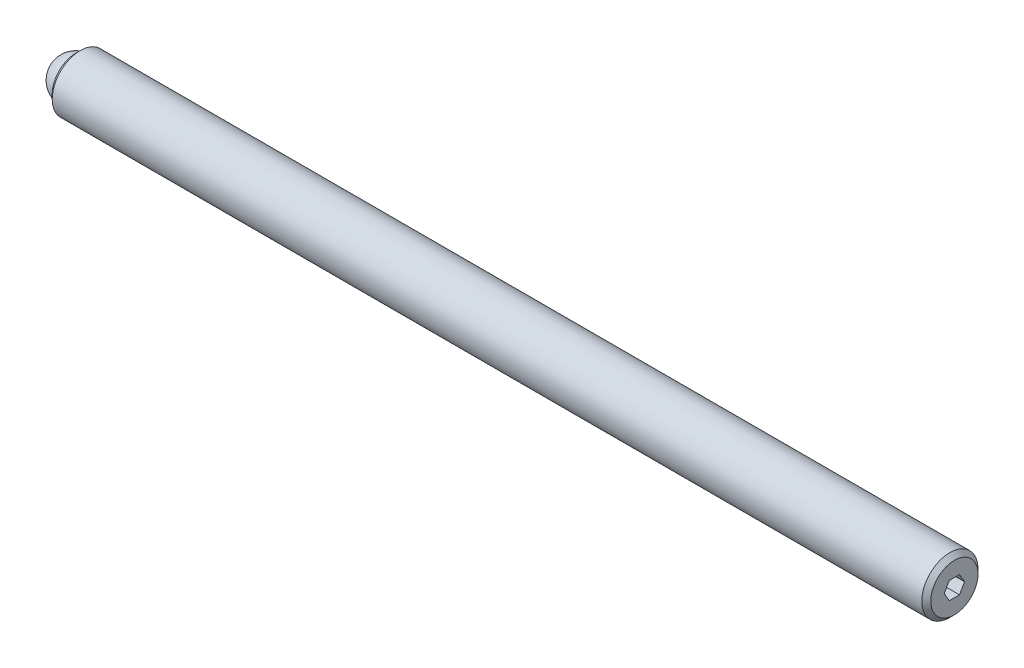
ISO-10303-21;
HEADER;
FILE_DESCRIPTION(('STEP AP214'),'2;1');
FILE_NAME('part.step','',(''),(''),'','','');
FILE_SCHEMA(('AUTOMOTIVE_DESIGN { 1 0 10303 214 1 1 1 1 }'));
ENDSEC;
DATA;
#1=APPLICATION_CONTEXT('core data for automotive mechanical design processes');
#2=APPLICATION_PROTOCOL_DEFINITION('international standard','automotive_design',2000,#1);
#3=PRODUCT_CONTEXT('',#1,'mechanical');
#4=PRODUCT('Part','Part','',(#3));
#5=PRODUCT_RELATED_PRODUCT_CATEGORY('part','',(#4));
#6=PRODUCT_DEFINITION_FORMATION('','',#4);
#7=PRODUCT_DEFINITION_CONTEXT('part definition',#1,'design');
#8=PRODUCT_DEFINITION('design','',#6,#7);
#9=PRODUCT_DEFINITION_SHAPE('','',#8);
#10=(LENGTH_UNIT() NAMED_UNIT(*) SI_UNIT(.MILLI.,.METRE.));
#11=(NAMED_UNIT(*) PLANE_ANGLE_UNIT() SI_UNIT($,.RADIAN.));
#12=(NAMED_UNIT(*) SI_UNIT($,.STERADIAN.) SOLID_ANGLE_UNIT());
#13=UNCERTAINTY_MEASURE_WITH_UNIT(LENGTH_MEASURE(1.E-05),#10,'distance_accuracy_value','');
#14=(GEOMETRIC_REPRESENTATION_CONTEXT(3) GLOBAL_UNCERTAINTY_ASSIGNED_CONTEXT((#13)) GLOBAL_UNIT_ASSIGNED_CONTEXT((#10,
#11,#12)) REPRESENTATION_CONTEXT('',''));
#15=CARTESIAN_POINT('',(0.,0.,0.));
#16=DIRECTION('',(0.,0.,1.));
#17=DIRECTION('',(1.,0.,0.));
#18=AXIS2_PLACEMENT_3D('',#15,#16,#17);
#19=CARTESIAN_POINT('',(0.,0.,0.));
#20=DIRECTION('',(0.,-1.,0.));
#21=DIRECTION('',(0.,0.,1.));
#22=AXIS2_PLACEMENT_3D('',#19,#20,#21);
#23=SPHERICAL_SURFACE('',#22,2.38125);
#24=CARTESIAN_POINT('',(0.,-2.38125,0.));
#25=VERTEX_POINT('',#24);
#26=VERTEX_LOOP('',#25);
#27=FACE_BOUND('',#26,.T.);
#28=ADVANCED_FACE('F43',(#27),#23,.T.);
#29=CLOSED_SHELL('',(#28));
#30=MANIFOLD_SOLID_BREP('B2',#29);
#31=CARTESIAN_POINT('',(99.21875,0.,0.));
#32=DIRECTION('',(-1.,0.,0.));
#33=DIRECTION('',(0.,0.,1.));
#34=AXIS2_PLACEMENT_3D('',#31,#32,#33);
#35=CYLINDRICAL_SURFACE('',#34,3.175);
#36=CARTESIAN_POINT('',(98.71075,0.,0.));
#37=DIRECTION('',(1.,0.,0.));
#38=DIRECTION('',(0.,0.,-1.));
#39=AXIS2_PLACEMENT_3D('',#36,#37,#38);
#40=CIRCLE('',#39,3.175);
#41=CARTESIAN_POINT('',(98.71075,0.,3.175));
#42=VERTEX_POINT('',#41);
#43=EDGE_CURVE('E41',#42,#42,#40,.F.);
#44=CARTESIAN_POINT('',(0.508000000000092,0.,0.));
#45=DIRECTION('',(1.,0.,0.));
#46=DIRECTION('',(0.,0.,-1.));
#47=AXIS2_PLACEMENT_3D('',#44,#45,#46);
#48=CIRCLE('',#47,3.175);
#49=CARTESIAN_POINT('',(0.508000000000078,0.,3.175));
#50=VERTEX_POINT('',#49);
#51=EDGE_CURVE('E159',#50,#50,#48,.T.);
#52=CARTESIAN_POINT('',(98.71075,0.,3.175));
#53=CARTESIAN_POINT('',(97.6878046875,0.,3.175));
#54=CARTESIAN_POINT('',(96.664859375,0.,3.175));
#55=CARTESIAN_POINT('',(94.6189687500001,0.,3.175));
#56=CARTESIAN_POINT('',(93.5960234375,0.,3.175));
#57=CARTESIAN_POINT('',(91.5501328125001,0.,3.175));
#58=CARTESIAN_POINT('',(90.5271875,0.,3.175));
#59=CARTESIAN_POINT('',(88.481296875,0.,3.175));
#60=CARTESIAN_POINT('',(87.4583515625,0.,3.175));
#61=CARTESIAN_POINT('',(85.4124609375,0.,3.175));
#62=CARTESIAN_POINT('',(84.389515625,0.,3.175));
#63=CARTESIAN_POINT('',(82.343625,0.,3.175));
#64=CARTESIAN_POINT('',(81.3206796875,0.,3.175));
#65=CARTESIAN_POINT('',(79.2747890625,0.,3.175));
#66=CARTESIAN_POINT('',(78.25184375,0.,3.175));
#67=CARTESIAN_POINT('',(76.2059531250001,0.,3.175));
#68=CARTESIAN_POINT('',(75.1830078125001,0.,3.175));
#69=CARTESIAN_POINT('',(73.1371171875,0.,3.175));
#70=CARTESIAN_POINT('',(72.1141718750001,0.,3.175));
#71=CARTESIAN_POINT('',(70.0682812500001,0.,3.175));
#72=CARTESIAN_POINT('',(69.0453359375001,0.,3.175));
#73=CARTESIAN_POINT('',(66.9994453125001,0.,3.175));
#74=CARTESIAN_POINT('',(65.9765,0.,3.175));
#75=CARTESIAN_POINT('',(63.9306093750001,0.,3.175));
#76=CARTESIAN_POINT('',(62.9076640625,0.,3.175));
#77=CARTESIAN_POINT('',(60.8617734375,0.,3.175));
#78=CARTESIAN_POINT('',(59.8388281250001,0.,3.175));
#79=CARTESIAN_POINT('',(57.7929375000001,0.,3.175));
#80=CARTESIAN_POINT('',(56.7699921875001,0.,3.175));
#81=CARTESIAN_POINT('',(54.7241015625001,0.,3.175));
#82=CARTESIAN_POINT('',(53.7011562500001,0.,3.175));
#83=CARTESIAN_POINT('',(51.6552656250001,0.,3.175));
#84=CARTESIAN_POINT('',(50.6323203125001,0.,3.175));
#85=CARTESIAN_POINT('',(48.5864296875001,0.,3.175));
#86=CARTESIAN_POINT('',(47.5634843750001,0.,3.175));
#87=CARTESIAN_POINT('',(45.5175937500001,0.,3.175));
#88=CARTESIAN_POINT('',(44.4946484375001,0.,3.175));
#89=CARTESIAN_POINT('',(42.4487578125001,0.,3.175));
#90=CARTESIAN_POINT('',(41.4258125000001,0.,3.175));
#91=CARTESIAN_POINT('',(39.3799218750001,0.,3.175));
#92=CARTESIAN_POINT('',(38.3569765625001,0.,3.175));
#93=CARTESIAN_POINT('',(36.3110859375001,0.,3.175));
#94=CARTESIAN_POINT('',(35.2881406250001,0.,3.175));
#95=CARTESIAN_POINT('',(33.2422500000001,0.,3.175));
#96=CARTESIAN_POINT('',(32.2193046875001,0.,3.175));
#97=CARTESIAN_POINT('',(30.1734140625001,0.,3.175));
#98=CARTESIAN_POINT('',(29.1504687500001,0.,3.175));
#99=CARTESIAN_POINT('',(27.1045781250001,0.,3.175));
#100=CARTESIAN_POINT('',(26.0816328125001,0.,3.175));
#101=CARTESIAN_POINT('',(24.0357421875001,0.,3.175));
#102=CARTESIAN_POINT('',(23.0127968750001,0.,3.175));
#103=CARTESIAN_POINT('',(20.9669062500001,0.,3.175));
#104=CARTESIAN_POINT('',(19.9439609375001,0.,3.175));
#105=CARTESIAN_POINT('',(17.8980703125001,0.,3.175));
#106=CARTESIAN_POINT('',(16.8751250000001,0.,3.175));
#107=CARTESIAN_POINT('',(14.8292343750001,0.,3.175));
#108=CARTESIAN_POINT('',(13.8062890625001,0.,3.175));
#109=CARTESIAN_POINT('',(11.7603984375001,0.,3.175));
#110=CARTESIAN_POINT('',(10.7374531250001,0.,3.175));
#111=CARTESIAN_POINT('',(8.69156250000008,0.,3.175));
#112=CARTESIAN_POINT('',(7.66861718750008,0.,3.175));
#113=CARTESIAN_POINT('',(5.62272656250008,0.,3.175));
#114=CARTESIAN_POINT('',(4.59978125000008,0.,3.175));
#115=CARTESIAN_POINT('',(2.55389062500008,0.,3.175));
#116=CARTESIAN_POINT('',(1.53094531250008,0.,3.175));
#117=CARTESIAN_POINT('',(0.508000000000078,0.,3.175));
#118=B_SPLINE_CURVE_WITH_KNOTS('',3,(#52,#53,#54,#55,#56,#57,#58,#59,#60,#61,#62,#63,#64,#65,
#66,#67,#68,#69,#70,#71,#72,#73,#74,#75,#76,#77,#78,#79,#80,#81,#82,#83,#84,#85,#86,#87,#88,#89,
#90,#91,#92,#93,#94,#95,#96,#97,#98,#99,#100,#101,#102,#103,#104,#105,#106,#107,#108,#109,#110,
#111,#112,#113,#114,#115,#116,#117),.UNSPECIFIED.,.F.,.F.,(4,2,2,2,2,2,2,2,2,2,2,2,2,2,2,2,2,2,
2,2,2,2,2,2,2,2,2,2,2,2,2,2,4),(0.,3.06883593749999,6.13767187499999,9.20650781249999,
12.27534375,15.3441796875,18.413015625,21.4818515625,24.5506875,27.6195234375,30.688359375,
33.7571953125,36.82603125,39.8948671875,42.963703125,46.0325390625,49.101375,52.1702109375,
55.239046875,58.3078828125,61.37671875,64.4455546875,67.514390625,70.5832265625,73.6520625,
76.7208984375,79.789734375,82.8585703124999,85.9274062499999,88.9962421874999,92.0650781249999,
95.1339140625,98.20275),.UNSPECIFIED.);
#119=EDGE_CURVE('BSEAM56',#42,#50,#118,.T.);
#120=ORIENTED_EDGE('',*,*,#43,.T.);
#121=ORIENTED_EDGE('',*,*,#51,.T.);
#122=ORIENTED_EDGE('',*,*,#119,.T.);
#123=ORIENTED_EDGE('',*,*,#119,.F.);
#124=EDGE_LOOP('',(#120,#122,#121,#123));
#125=FACE_BOUND('',#124,.T.);
#126=ADVANCED_FACE('F56',(#125),#35,.T.);
#127=CARTESIAN_POINT('',(99.21875,0.,0.));
#128=DIRECTION('',(1.,0.,0.));
#129=DIRECTION('',(0.,0.,-1.));
#130=AXIS2_PLACEMENT_3D('',#127,#128,#129);
#131=PLANE('',#130);
#132=DIRECTION('',(0.,0.866025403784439,-0.5));
#133=VECTOR('',#132,1.);
#134=CARTESIAN_POINT('',(99.21875,-0.9921875,-0.572839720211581));
#135=LINE('',#134,#133);
#136=CARTESIAN_POINT('',(99.21875,-0.9921875,-0.572839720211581));
#137=VERTEX_POINT('',#136);
#138=CARTESIAN_POINT('',(99.21875,0.,-1.14567944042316));
#139=VERTEX_POINT('',#138);
#140=EDGE_CURVE('E71',#137,#139,#135,.T.);
#141=ORIENTED_EDGE('',*,*,#140,.F.);
#142=DIRECTION('',(0.,0.,-1.));
#143=VECTOR('',#142,1.);
#144=CARTESIAN_POINT('',(99.21875,-0.9921875,0.572839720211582));
#145=LINE('',#144,#143);
#146=CARTESIAN_POINT('',(99.21875,-0.9921875,0.572839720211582));
#147=VERTEX_POINT('',#146);
#148=EDGE_CURVE('E155',#147,#137,#145,.T.);
#149=ORIENTED_EDGE('',*,*,#148,.F.);
#150=DIRECTION('',(0.,-0.866025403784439,-0.5));
#151=VECTOR('',#150,1.);
#152=CARTESIAN_POINT('',(99.21875,0.,1.14567944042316));
#153=LINE('',#152,#151);
#154=CARTESIAN_POINT('',(99.21875,0.,1.14567944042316));
#155=VERTEX_POINT('',#154);
#156=EDGE_CURVE('E153',#155,#147,#153,.T.);
#157=ORIENTED_EDGE('',*,*,#156,.F.);
#158=DIRECTION('',(0.,-0.866025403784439,0.5));
#159=VECTOR('',#158,1.);
#160=CARTESIAN_POINT('',(99.21875,0.992187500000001,0.572839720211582));
#161=LINE('',#160,#159);
#162=CARTESIAN_POINT('',(99.21875,0.992187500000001,0.572839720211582));
#163=VERTEX_POINT('',#162);
#164=EDGE_CURVE('E119',#163,#155,#161,.T.);
#165=ORIENTED_EDGE('',*,*,#164,.F.);
#166=DIRECTION('',(0.,0.,1.));
#167=VECTOR('',#166,1.);
#168=CARTESIAN_POINT('',(99.21875,0.9921875,-0.572839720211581));
#169=LINE('',#168,#167);
#170=CARTESIAN_POINT('',(99.21875,0.9921875,-0.572839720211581));
#171=VERTEX_POINT('',#170);
#172=EDGE_CURVE('E149',#171,#163,#169,.T.);
#173=ORIENTED_EDGE('',*,*,#172,.F.);
#174=DIRECTION('',(0.,0.866025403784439,0.5));
#175=VECTOR('',#174,1.);
#176=CARTESIAN_POINT('',(99.21875,0.,-1.14567944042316));
#177=LINE('',#176,#175);
#178=EDGE_CURVE('E145',#139,#171,#177,.T.);
#179=ORIENTED_EDGE('',*,*,#178,.F.);
#180=EDGE_LOOP('',(#141,#149,#157,#165,#173,#179));
#181=FACE_BOUND('',#180,.T.);
#182=CARTESIAN_POINT('',(99.21875,0.,0.));
#183=DIRECTION('',(1.,0.,0.));
#184=DIRECTION('',(0.,0.,-1.));
#185=AXIS2_PLACEMENT_3D('',#182,#183,#184);
#186=CIRCLE('',#185,2.66700000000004);
#187=CARTESIAN_POINT('',(99.21875,0.,-2.66700000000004));
#188=VERTEX_POINT('',#187);
#189=EDGE_CURVE('E64',#188,#188,#186,.T.);
#190=ORIENTED_EDGE('',*,*,#189,.T.);
#191=EDGE_LOOP('',(#190));
#192=FACE_BOUND('',#191,.T.);
#193=ADVANCED_FACE('F172',(#181,#192),#131,.T.);
#194=CARTESIAN_POINT('',(0.,0.,0.));
#195=DIRECTION('',(1.,0.,0.));
#196=DIRECTION('',(0.,0.,-1.));
#197=AXIS2_PLACEMENT_3D('',#194,#195,#196);
#198=PLANE('',#197);
#199=CARTESIAN_POINT('',(0.,0.,0.));
#200=DIRECTION('',(-1.,0.,0.));
#201=DIRECTION('',(0.,0.,1.));
#202=AXIS2_PLACEMENT_3D('',#199,#200,#201);
#203=CIRCLE('',#202,2.38125);
#204=CARTESIAN_POINT('',(0.,0.,2.38125));
#205=VERTEX_POINT('',#204);
#206=EDGE_CURVE('E227',#205,#205,#203,.T.);
#207=ORIENTED_EDGE('',*,*,#206,.F.);
#208=EDGE_LOOP('',(#207));
#209=FACE_BOUND('',#208,.T.);
#210=CARTESIAN_POINT('',(0.,0.,0.));
#211=DIRECTION('',(1.,0.,0.));
#212=DIRECTION('',(0.,0.,-1.));
#213=AXIS2_PLACEMENT_3D('',#210,#211,#212);
#214=CIRCLE('',#213,2.66699999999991);
#215=CARTESIAN_POINT('',(0.,0.,-2.66699999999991));
#216=VERTEX_POINT('',#215);
#217=EDGE_CURVE('E167',#216,#216,#214,.F.);
#218=ORIENTED_EDGE('',*,*,#217,.T.);
#219=EDGE_LOOP('',(#218));
#220=FACE_BOUND('',#219,.T.);
#221=ADVANCED_FACE('F184',(#209,#220),#198,.F.);
#222=CARTESIAN_POINT('',(0.508000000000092,0.,0.));
#223=DIRECTION('',(1.,0.,0.));
#224=DIRECTION('',(0.,0.,-1.));
#225=AXIS2_PLACEMENT_3D('',#222,#223,#224);
#226=CONICAL_SURFACE('',#225,3.175,0.785398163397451);
#227=ORIENTED_EDGE('',*,*,#217,.F.);
#228=EDGE_LOOP('',(#227));
#229=FACE_BOUND('',#228,.T.);
#230=ORIENTED_EDGE('',*,*,#51,.F.);
#231=EDGE_LOOP('',(#230));
#232=FACE_BOUND('',#231,.T.);
#233=ADVANCED_FACE('F176',(#229,#232),#226,.T.);
#234=CARTESIAN_POINT('',(99.21875,0.,0.));
#235=DIRECTION('',(-1.,0.,0.));
#236=DIRECTION('',(0.,0.,1.));
#237=AXIS2_PLACEMENT_3D('',#234,#235,#236);
#238=CONICAL_SURFACE('',#237,2.66700000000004,0.785398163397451);
#239=ORIENTED_EDGE('',*,*,#43,.F.);
#240=EDGE_LOOP('',(#239));
#241=FACE_BOUND('',#240,.T.);
#242=ORIENTED_EDGE('',*,*,#189,.F.);
#243=EDGE_LOOP('',(#242));
#244=FACE_BOUND('',#243,.T.);
#245=ADVANCED_FACE('F58',(#241,#244),#238,.T.);
#246=CARTESIAN_POINT('',(96.93275,-0.9921875,-0.572839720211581));
#247=DIRECTION('',(0.,-0.5,-0.866025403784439));
#248=DIRECTION('',(0.,0.866025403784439,-0.5));
#249=AXIS2_PLACEMENT_3D('',#246,#247,#248);
#250=PLANE('',#249);
#251=ORIENTED_EDGE('',*,*,#140,.T.);
#252=DIRECTION('',(1.,0.,0.));
#253=VECTOR('',#252,1.);
#254=CARTESIAN_POINT('',(96.93275,0.,-1.14567944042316));
#255=LINE('',#254,#253);
#256=CARTESIAN_POINT('',(96.93275,0.,-1.14567944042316));
#257=VERTEX_POINT('',#256);
#258=EDGE_CURVE('E101',#257,#139,#255,.T.);
#259=ORIENTED_EDGE('',*,*,#258,.F.);
#260=DIRECTION('',(0.,0.866025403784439,-0.5));
#261=VECTOR('',#260,1.);
#262=CARTESIAN_POINT('',(96.93275,-0.9921875,-0.572839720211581));
#263=LINE('',#262,#261);
#264=CARTESIAN_POINT('',(96.93275,-0.9921875,-0.572839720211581));
#265=VERTEX_POINT('',#264);
#266=EDGE_CURVE('E157',#265,#257,#263,.T.);
#267=ORIENTED_EDGE('',*,*,#266,.F.);
#268=DIRECTION('',(1.,0.,0.));
#269=VECTOR('',#268,1.);
#270=CARTESIAN_POINT('',(96.93275,-0.9921875,-0.572839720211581));
#271=LINE('',#270,#269);
#272=EDGE_CURVE('E79',#265,#137,#271,.T.);
#273=ORIENTED_EDGE('',*,*,#272,.T.);
#274=EDGE_LOOP('',(#251,#259,#267,#273));
#275=FACE_BOUND('',#274,.T.);
#276=ADVANCED_FACE('F175',(#275),#250,.F.);
#277=CARTESIAN_POINT('',(96.93275,-0.9921875,0.572839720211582));
#278=DIRECTION('',(0.,-1.,0.));
#279=DIRECTION('',(0.,0.,-1.));
#280=AXIS2_PLACEMENT_3D('',#277,#278,#279);
#281=PLANE('',#280);
#282=ORIENTED_EDGE('',*,*,#148,.T.);
#283=ORIENTED_EDGE('',*,*,#272,.F.);
#284=DIRECTION('',(0.,0.,-1.));
#285=VECTOR('',#284,1.);
#286=CARTESIAN_POINT('',(96.93275,-0.9921875,0.572839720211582));
#287=LINE('',#286,#285);
#288=CARTESIAN_POINT('',(96.93275,-0.9921875,0.572839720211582));
#289=VERTEX_POINT('',#288);
#290=EDGE_CURVE('E131',#289,#265,#287,.T.);
#291=ORIENTED_EDGE('',*,*,#290,.F.);
#292=DIRECTION('',(1.,0.,0.));
#293=VECTOR('',#292,1.);
#294=CARTESIAN_POINT('',(96.93275,-0.9921875,0.572839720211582));
#295=LINE('',#294,#293);
#296=EDGE_CURVE('E123',#289,#147,#295,.T.);
#297=ORIENTED_EDGE('',*,*,#296,.T.);
#298=EDGE_LOOP('',(#282,#283,#291,#297));
#299=FACE_BOUND('',#298,.T.);
#300=ADVANCED_FACE('F182',(#299),#281,.F.);
#301=CARTESIAN_POINT('',(96.93275,0.,1.14567944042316));
#302=DIRECTION('',(0.,-0.5,0.866025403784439));
#303=DIRECTION('',(0.,-0.866025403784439,-0.5));
#304=AXIS2_PLACEMENT_3D('',#301,#302,#303);
#305=PLANE('',#304);
#306=ORIENTED_EDGE('',*,*,#156,.T.);
#307=ORIENTED_EDGE('',*,*,#296,.F.);
#308=DIRECTION('',(0.,-0.866025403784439,-0.5));
#309=VECTOR('',#308,1.);
#310=CARTESIAN_POINT('',(96.93275,0.,1.14567944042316));
#311=LINE('',#310,#309);
#312=CARTESIAN_POINT('',(96.93275,0.,1.14567944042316));
#313=VERTEX_POINT('',#312);
#314=EDGE_CURVE('E127',#313,#289,#311,.T.);
#315=ORIENTED_EDGE('',*,*,#314,.F.);
#316=DIRECTION('',(1.,0.,0.));
#317=VECTOR('',#316,1.);
#318=CARTESIAN_POINT('',(96.93275,0.,1.14567944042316));
#319=LINE('',#318,#317);
#320=EDGE_CURVE('E112',#313,#155,#319,.T.);
#321=ORIENTED_EDGE('',*,*,#320,.T.);
#322=EDGE_LOOP('',(#306,#307,#315,#321));
#323=FACE_BOUND('',#322,.T.);
#324=ADVANCED_FACE('F128',(#323),#305,.F.);
#325=CARTESIAN_POINT('',(96.93275,0.992187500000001,0.572839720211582));
#326=DIRECTION('',(0.,0.5,0.866025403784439));
#327=DIRECTION('',(0.,-0.866025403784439,0.5));
#328=AXIS2_PLACEMENT_3D('',#325,#326,#327);
#329=PLANE('',#328);
#330=ORIENTED_EDGE('',*,*,#164,.T.);
#331=ORIENTED_EDGE('',*,*,#320,.F.);
#332=DIRECTION('',(0.,-0.866025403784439,0.5));
#333=VECTOR('',#332,1.);
#334=CARTESIAN_POINT('',(96.93275,0.992187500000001,0.572839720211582));
#335=LINE('',#334,#333);
#336=CARTESIAN_POINT('',(96.93275,0.992187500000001,0.572839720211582));
#337=VERTEX_POINT('',#336);
#338=EDGE_CURVE('E116',#337,#313,#335,.T.);
#339=ORIENTED_EDGE('',*,*,#338,.F.);
#340=DIRECTION('',(1.,0.,0.));
#341=VECTOR('',#340,1.);
#342=CARTESIAN_POINT('',(96.93275,0.992187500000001,0.572839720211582));
#343=LINE('',#342,#341);
#344=EDGE_CURVE('E124',#337,#163,#343,.T.);
#345=ORIENTED_EDGE('',*,*,#344,.T.);
#346=EDGE_LOOP('',(#330,#331,#339,#345));
#347=FACE_BOUND('',#346,.T.);
#348=ADVANCED_FACE('F114',(#347),#329,.F.);
#349=CARTESIAN_POINT('',(96.93275,0.9921875,-0.572839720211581));
#350=DIRECTION('',(0.,1.,0.));
#351=DIRECTION('',(0.,0.,1.));
#352=AXIS2_PLACEMENT_3D('',#349,#350,#351);
#353=PLANE('',#352);
#354=ORIENTED_EDGE('',*,*,#172,.T.);
#355=ORIENTED_EDGE('',*,*,#344,.F.);
#356=DIRECTION('',(0.,0.,1.));
#357=VECTOR('',#356,1.);
#358=CARTESIAN_POINT('',(96.93275,0.9921875,-0.572839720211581));
#359=LINE('',#358,#357);
#360=CARTESIAN_POINT('',(96.93275,0.9921875,-0.572839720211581));
#361=VERTEX_POINT('',#360);
#362=EDGE_CURVE('E137',#361,#337,#359,.T.);
#363=ORIENTED_EDGE('',*,*,#362,.F.);
#364=DIRECTION('',(1.,0.,0.));
#365=VECTOR('',#364,1.);
#366=CARTESIAN_POINT('',(96.93275,0.9921875,-0.572839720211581));
#367=LINE('',#366,#365);
#368=EDGE_CURVE('E162',#361,#171,#367,.T.);
#369=ORIENTED_EDGE('',*,*,#368,.T.);
#370=EDGE_LOOP('',(#354,#355,#363,#369));
#371=FACE_BOUND('',#370,.T.);
#372=ADVANCED_FACE('F203',(#371),#353,.F.);
#373=CARTESIAN_POINT('',(96.93275,0.,-1.14567944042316));
#374=DIRECTION('',(0.,0.5,-0.866025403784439));
#375=DIRECTION('',(0.,0.866025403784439,0.5));
#376=AXIS2_PLACEMENT_3D('',#373,#374,#375);
#377=PLANE('',#376);
#378=ORIENTED_EDGE('',*,*,#178,.T.);
#379=ORIENTED_EDGE('',*,*,#368,.F.);
#380=DIRECTION('',(0.,0.866025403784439,0.5));
#381=VECTOR('',#380,1.);
#382=CARTESIAN_POINT('',(96.93275,0.,-1.14567944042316));
#383=LINE('',#382,#381);
#384=EDGE_CURVE('E139',#257,#361,#383,.T.);
#385=ORIENTED_EDGE('',*,*,#384,.F.);
#386=ORIENTED_EDGE('',*,*,#258,.T.);
#387=EDGE_LOOP('',(#378,#379,#385,#386));
#388=FACE_BOUND('',#387,.T.);
#389=ADVANCED_FACE('F200',(#388),#377,.F.);
#390=CARTESIAN_POINT('',(96.93275,0.,0.));
#391=DIRECTION('',(1.,0.,0.));
#392=DIRECTION('',(0.,0.,-1.));
#393=AXIS2_PLACEMENT_3D('',#390,#391,#392);
#394=PLANE('',#393);
#395=ORIENTED_EDGE('',*,*,#266,.T.);
#396=ORIENTED_EDGE('',*,*,#384,.T.);
#397=ORIENTED_EDGE('',*,*,#362,.T.);
#398=ORIENTED_EDGE('',*,*,#338,.T.);
#399=ORIENTED_EDGE('',*,*,#314,.T.);
#400=ORIENTED_EDGE('',*,*,#290,.T.);
#401=EDGE_LOOP('',(#395,#396,#397,#398,#399,#400));
#402=FACE_BOUND('',#401,.T.);
#403=ADVANCED_FACE('F134',(#402),#394,.T.);
#404=CARTESIAN_POINT('',(1.984375,0.,0.));
#405=DIRECTION('',(-1.,0.,0.));
#406=DIRECTION('',(0.,0.,1.));
#407=AXIS2_PLACEMENT_3D('',#404,#405,#406);
#408=CYLINDRICAL_SURFACE('',#407,2.38125);
#409=CARTESIAN_POINT('',(1.984375,0.,0.));
#410=DIRECTION('',(-1.,0.,0.));
#411=DIRECTION('',(0.,0.,1.));
#412=AXIS2_PLACEMENT_3D('',#409,#410,#411);
#413=CIRCLE('',#412,2.38125);
#414=CARTESIAN_POINT('',(1.984375,0.,2.38125));
#415=VERTEX_POINT('',#414);
#416=EDGE_CURVE('E146',#415,#415,#413,.T.);
#417=ORIENTED_EDGE('',*,*,#416,.F.);
#418=EDGE_LOOP('',(#417));
#419=FACE_BOUND('',#418,.T.);
#420=ORIENTED_EDGE('',*,*,#206,.T.);
#421=EDGE_LOOP('',(#420));
#422=FACE_BOUND('',#421,.T.);
#423=ADVANCED_FACE('F216',(#419,#422),#408,.F.);
#424=CARTESIAN_POINT('',(1.984375,0.,0.));
#425=DIRECTION('',(-1.,0.,0.));
#426=DIRECTION('',(0.,0.,1.));
#427=AXIS2_PLACEMENT_3D('',#424,#425,#426);
#428=PLANE('',#427);
#429=ORIENTED_EDGE('',*,*,#416,.T.);
#430=EDGE_LOOP('',(#429));
#431=FACE_BOUND('',#430,.T.);
#432=ADVANCED_FACE('F219',(#431),#428,.T.);
#433=CLOSED_SHELL('',(#126,#193,#221,#233,#245,#276,#300,#324,#348,#372,#389,#403,#423,#432));
#434=MANIFOLD_SOLID_BREP('B6',#433);
#435=ADVANCED_BREP_SHAPE_REPRESENTATION('',(#18,#30,#434),#14);
#436=SHAPE_DEFINITION_REPRESENTATION(#9,#435);
ENDSEC;
END-ISO-10303-21;
